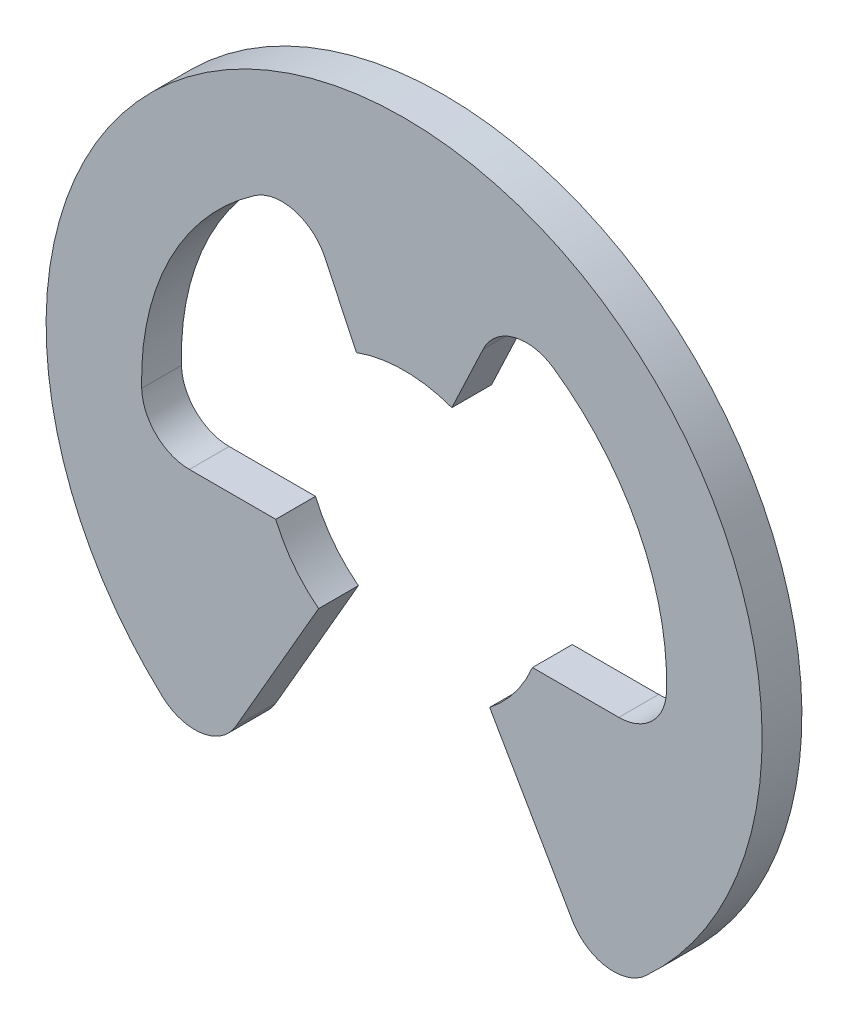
ISO-10303-21;
HEADER;
FILE_DESCRIPTION(('STEP AP214'),'2;1');
FILE_NAME('part.step','',(''),(''),'','','');
FILE_SCHEMA(('AUTOMOTIVE_DESIGN { 1 0 10303 214 1 1 1 1 }'));
ENDSEC;
DATA;
#1=APPLICATION_CONTEXT('core data for automotive mechanical design processes');
#2=APPLICATION_PROTOCOL_DEFINITION('international standard','automotive_design',2000,#1);
#3=PRODUCT_CONTEXT('',#1,'mechanical');
#4=PRODUCT('Part','Part','',(#3));
#5=PRODUCT_RELATED_PRODUCT_CATEGORY('part','',(#4));
#6=PRODUCT_DEFINITION_FORMATION('','',#4);
#7=PRODUCT_DEFINITION_CONTEXT('part definition',#1,'design');
#8=PRODUCT_DEFINITION('design','',#6,#7);
#9=PRODUCT_DEFINITION_SHAPE('','',#8);
#10=(LENGTH_UNIT() NAMED_UNIT(*) SI_UNIT(.MILLI.,.METRE.));
#11=(NAMED_UNIT(*) PLANE_ANGLE_UNIT() SI_UNIT($,.RADIAN.));
#12=(NAMED_UNIT(*) SI_UNIT($,.STERADIAN.) SOLID_ANGLE_UNIT());
#13=UNCERTAINTY_MEASURE_WITH_UNIT(LENGTH_MEASURE(1.E-05),#10,'distance_accuracy_value','');
#14=(GEOMETRIC_REPRESENTATION_CONTEXT(3) GLOBAL_UNCERTAINTY_ASSIGNED_CONTEXT((#13)) GLOBAL_UNIT_ASSIGNED_CONTEXT((#10,
#11,#12)) REPRESENTATION_CONTEXT('',''));
#15=CARTESIAN_POINT('',(0.,0.,0.));
#16=DIRECTION('',(0.,0.,1.));
#17=DIRECTION('',(1.,0.,0.));
#18=AXIS2_PLACEMENT_3D('',#15,#16,#17);
#19=CARTESIAN_POINT('',(0.67174142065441,0.32292759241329,0.));
#20=DIRECTION('',(0.,0.,-1.));
#21=DIRECTION('',(-1.,0.,0.));
#22=AXIS2_PLACEMENT_3D('',#19,#20,#21);
#23=CYLINDRICAL_SURFACE('',#22,3.29999999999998);
#24=CARTESIAN_POINT('',(0.67174142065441,0.32292759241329,-0.5));
#25=DIRECTION('',(0.,0.,1.));
#26=DIRECTION('',(1.,0.,0.));
#27=AXIS2_PLACEMENT_3D('',#24,#25,#26);
#28=CIRCLE('',#27,3.29999999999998);
#29=CARTESIAN_POINT('',(3.97037244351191,0.227883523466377,-0.5));
#30=VERTEX_POINT('',#29);
#31=CARTESIAN_POINT('',(2.54863712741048,3.03719775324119,-0.5));
#32=VERTEX_POINT('',#31);
#33=EDGE_CURVE('E474',#30,#32,#28,.T.);
#34=ORIENTED_EDGE('',*,*,#33,.F.);
#35=DIRECTION('',(0.,0.,-1.));
#36=VECTOR('',#35,1.);
#37=CARTESIAN_POINT('',(3.97037244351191,0.227883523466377,0.));
#38=LINE('',#37,#36);
#39=CARTESIAN_POINT('',(3.97037244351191,0.227883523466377,0.));
#40=VERTEX_POINT('',#39);
#41=EDGE_CURVE('E11',#40,#30,#38,.T.);
#42=ORIENTED_EDGE('',*,*,#41,.F.);
#43=CARTESIAN_POINT('',(0.67174142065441,0.32292759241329,0.));
#44=DIRECTION('',(0.,0.,1.));
#45=DIRECTION('',(1.,0.,0.));
#46=AXIS2_PLACEMENT_3D('',#43,#44,#45);
#47=CIRCLE('',#46,3.29999999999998);
#48=CARTESIAN_POINT('',(2.54863712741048,3.03719775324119,0.));
#49=VERTEX_POINT('',#48);
#50=EDGE_CURVE('E476',#40,#49,#47,.T.);
#51=ORIENTED_EDGE('',*,*,#50,.T.);
#52=DIRECTION('',(0.,0.,-1.));
#53=VECTOR('',#52,1.);
#54=CARTESIAN_POINT('',(2.54863712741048,3.03719775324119,0.));
#55=LINE('',#54,#53);
#56=EDGE_CURVE('E353',#49,#32,#55,.T.);
#57=ORIENTED_EDGE('',*,*,#56,.T.);
#58=EDGE_LOOP('',(#34,#42,#51,#57));
#59=FACE_BOUND('',#58,.T.);
#60=ADVANCED_FACE('F350',(#59),#23,.F.);
#61=CARTESIAN_POINT('',(3.3706213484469,0.2451642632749,0.));
#62=DIRECTION('',(0.,0.,-1.));
#63=DIRECTION('',(-1.,0.,0.));
#64=AXIS2_PLACEMENT_3D('',#61,#62,#63);
#65=CYLINDRICAL_SURFACE('',#64,0.600000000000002);
#66=CARTESIAN_POINT('',(3.3706213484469,0.2451642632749,-0.5));
#67=DIRECTION('',(0.,0.,1.));
#68=DIRECTION('',(1.,0.,0.));
#69=AXIS2_PLACEMENT_3D('',#66,#67,#68);
#70=CIRCLE('',#69,0.600000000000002);
#71=CARTESIAN_POINT('',(3.3706213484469,-0.3548357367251,-0.499999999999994));
#72=VERTEX_POINT('',#71);
#73=EDGE_CURVE('E492',#72,#30,#70,.T.);
#74=ORIENTED_EDGE('',*,*,#73,.F.);
#75=DIRECTION('',(0.,0.,-1.));
#76=VECTOR('',#75,1.);
#77=CARTESIAN_POINT('',(3.3706213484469,-0.3548357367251,0.));
#78=LINE('',#77,#76);
#79=CARTESIAN_POINT('',(3.3706213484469,-0.3548357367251,0.));
#80=VERTEX_POINT('',#79);
#81=EDGE_CURVE('E358',#80,#72,#78,.T.);
#82=ORIENTED_EDGE('',*,*,#81,.F.);
#83=CARTESIAN_POINT('',(3.3706213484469,0.2451642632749,0.));
#84=DIRECTION('',(0.,0.,1.));
#85=DIRECTION('',(1.,0.,0.));
#86=AXIS2_PLACEMENT_3D('',#83,#84,#85);
#87=CIRCLE('',#86,0.600000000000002);
#88=EDGE_CURVE('E481',#80,#40,#87,.T.);
#89=ORIENTED_EDGE('',*,*,#88,.T.);
#90=ORIENTED_EDGE('',*,*,#41,.T.);
#91=EDGE_LOOP('',(#74,#82,#89,#90));
#92=FACE_BOUND('',#91,.T.);
#93=ADVANCED_FACE('F671',(#92),#65,.F.);
#94=CARTESIAN_POINT('',(2.28516537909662,-0.354835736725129,0.));
#95=DIRECTION('',(0.,1.,0.));
#96=DIRECTION('',(-1.,0.,0.));
#97=AXIS2_PLACEMENT_3D('',#94,#95,#96);
#98=PLANE('',#97);
#99=DIRECTION('',(1.,0.,0.));
#100=VECTOR('',#99,1.);
#101=CARTESIAN_POINT('',(2.28516537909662,-0.354835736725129,-0.5));
#102=LINE('',#101,#100);
#103=CARTESIAN_POINT('',(2.28516537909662,-0.354835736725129,-0.5));
#104=VERTEX_POINT('',#103);
#105=EDGE_CURVE('E535',#104,#72,#102,.T.);
#106=ORIENTED_EDGE('',*,*,#105,.F.);
#107=DIRECTION('',(0.,0.,-1.));
#108=VECTOR('',#107,1.);
#109=CARTESIAN_POINT('',(2.28516537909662,-0.354835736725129,0.));
#110=LINE('',#109,#108);
#111=CARTESIAN_POINT('',(2.28516537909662,-0.354835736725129,0.));
#112=VERTEX_POINT('',#111);
#113=EDGE_CURVE('E587',#112,#104,#110,.T.);
#114=ORIENTED_EDGE('',*,*,#113,.F.);
#115=DIRECTION('',(1.,0.,0.));
#116=VECTOR('',#115,1.);
#117=CARTESIAN_POINT('',(2.28516537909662,-0.354835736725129,0.));
#118=LINE('',#117,#116);
#119=EDGE_CURVE('E583',#112,#80,#118,.T.);
#120=ORIENTED_EDGE('',*,*,#119,.T.);
#121=ORIENTED_EDGE('',*,*,#81,.T.);
#122=EDGE_LOOP('',(#106,#114,#120,#121));
#123=FACE_BOUND('',#122,.T.);
#124=ADVANCED_FACE('F676',(#123),#98,.T.);
#125=CARTESIAN_POINT('',(0.67174142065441,0.32292759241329,0.));
#126=DIRECTION('',(0.,0.,-1.));
#127=DIRECTION('',(-1.,0.,0.));
#128=AXIS2_PLACEMENT_3D('',#125,#126,#127);
#129=CYLINDRICAL_SURFACE('',#128,1.75000000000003);
#130=CARTESIAN_POINT('',(0.67174142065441,0.32292759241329,-0.5));
#131=DIRECTION('',(0.,0.,1.));
#132=DIRECTION('',(1.,0.,0.));
#133=AXIS2_PLACEMENT_3D('',#130,#131,#132);
#134=CIRCLE('',#133,1.75000000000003);
#135=CARTESIAN_POINT('',(1.7468541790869,-1.057881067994,-0.500000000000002));
#136=VERTEX_POINT('',#135);
#137=EDGE_CURVE('E532',#136,#104,#134,.T.);
#138=ORIENTED_EDGE('',*,*,#137,.F.);
#139=DIRECTION('',(0.,0.,-1.));
#140=VECTOR('',#139,1.);
#141=CARTESIAN_POINT('',(1.7468541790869,-1.057881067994,0.));
#142=LINE('',#141,#140);
#143=CARTESIAN_POINT('',(1.7468541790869,-1.057881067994,0.));
#144=VERTEX_POINT('',#143);
#145=EDGE_CURVE('E589',#144,#136,#142,.T.);
#146=ORIENTED_EDGE('',*,*,#145,.F.);
#147=CARTESIAN_POINT('',(0.67174142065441,0.32292759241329,0.));
#148=DIRECTION('',(0.,0.,1.));
#149=DIRECTION('',(1.,0.,0.));
#150=AXIS2_PLACEMENT_3D('',#147,#148,#149);
#151=CIRCLE('',#150,1.75000000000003);
#152=EDGE_CURVE('E580',#144,#112,#151,.T.);
#153=ORIENTED_EDGE('',*,*,#152,.T.);
#154=ORIENTED_EDGE('',*,*,#113,.T.);
#155=EDGE_LOOP('',(#138,#146,#153,#154));
#156=FACE_BOUND('',#155,.T.);
#157=ADVANCED_FACE('F668',(#156),#129,.F.);
#158=CARTESIAN_POINT('',(2.78432644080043,-2.85483573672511,0.));
#159=DIRECTION('',(-0.866025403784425,-0.500000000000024,0.));
#160=DIRECTION('',(0.500000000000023,-0.866025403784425,0.));
#161=AXIS2_PLACEMENT_3D('',#158,#159,#160);
#162=PLANE('',#161);
#163=DIRECTION('',(-0.500000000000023,0.866025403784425,0.));
#164=VECTOR('',#163,1.);
#165=CARTESIAN_POINT('',(2.78432644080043,-2.85483573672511,-0.5));
#166=LINE('',#165,#164);
#167=CARTESIAN_POINT('',(2.78432644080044,-2.8548357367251,-0.5));
#168=VERTEX_POINT('',#167);
#169=EDGE_CURVE('E529',#168,#136,#166,.T.);
#170=ORIENTED_EDGE('',*,*,#169,.F.);
#171=DIRECTION('',(0.,0.,-1.));
#172=VECTOR('',#171,1.);
#173=CARTESIAN_POINT('',(2.78432644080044,-2.8548357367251,0.));
#174=LINE('',#173,#172);
#175=CARTESIAN_POINT('',(2.78432644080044,-2.8548357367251,0.));
#176=VERTEX_POINT('',#175);
#177=EDGE_CURVE('E591',#176,#168,#174,.T.);
#178=ORIENTED_EDGE('',*,*,#177,.F.);
#179=DIRECTION('',(-0.500000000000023,0.866025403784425,0.));
#180=VECTOR('',#179,1.);
#181=CARTESIAN_POINT('',(2.78432644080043,-2.85483573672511,0.));
#182=LINE('',#181,#180);
#183=EDGE_CURVE('E577',#176,#144,#182,.T.);
#184=ORIENTED_EDGE('',*,*,#183,.T.);
#185=ORIENTED_EDGE('',*,*,#145,.T.);
#186=EDGE_LOOP('',(#170,#178,#184,#185));
#187=FACE_BOUND('',#186,.T.);
#188=ADVANCED_FACE('F664',(#187),#162,.T.);
#189=CARTESIAN_POINT('',(3.3039416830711,-2.5548357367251,0.));
#190=DIRECTION('',(0.,0.,-1.));
#191=DIRECTION('',(-1.,0.,0.));
#192=AXIS2_PLACEMENT_3D('',#189,#190,#191);
#193=CYLINDRICAL_SURFACE('',#192,0.600000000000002);
#194=CARTESIAN_POINT('',(3.3039416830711,-2.5548357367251,-0.5));
#195=DIRECTION('',(0.,0.,-1.));
#196=DIRECTION('',(-1.,0.,0.));
#197=AXIS2_PLACEMENT_3D('',#194,#195,#196);
#198=CIRCLE('',#197,0.600000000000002);
#199=CARTESIAN_POINT('',(3.70889556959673,-2.99756855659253,-0.5));
#200=VERTEX_POINT('',#199);
#201=EDGE_CURVE('E526',#200,#168,#198,.T.);
#202=ORIENTED_EDGE('',*,*,#201,.F.);
#203=DIRECTION('',(0.,0.,-1.));
#204=VECTOR('',#203,1.);
#205=CARTESIAN_POINT('',(3.70889556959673,-2.99756855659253,0.));
#206=LINE('',#205,#204);
#207=CARTESIAN_POINT('',(3.70889556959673,-2.99756855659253,0.));
#208=VERTEX_POINT('',#207);
#209=EDGE_CURVE('E593',#208,#200,#206,.T.);
#210=ORIENTED_EDGE('',*,*,#209,.F.);
#211=CARTESIAN_POINT('',(3.3039416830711,-2.5548357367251,0.));
#212=DIRECTION('',(0.,0.,-1.));
#213=DIRECTION('',(-1.,0.,0.));
#214=AXIS2_PLACEMENT_3D('',#211,#212,#213);
#215=CIRCLE('',#214,0.600000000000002);
#216=EDGE_CURVE('E574',#208,#176,#215,.T.);
#217=ORIENTED_EDGE('',*,*,#216,.T.);
#218=ORIENTED_EDGE('',*,*,#177,.T.);
#219=EDGE_LOOP('',(#202,#210,#217,#218));
#220=FACE_BOUND('',#219,.T.);
#221=ADVANCED_FACE('F660',(#220),#193,.T.);
#222=CARTESIAN_POINT('',(0.67174142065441,0.32292759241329,0.));
#223=DIRECTION('',(0.,0.,-1.));
#224=DIRECTION('',(-1.,0.,0.));
#225=AXIS2_PLACEMENT_3D('',#222,#223,#224);
#226=CYLINDRICAL_SURFACE('',#225,4.5);
#227=CARTESIAN_POINT('',(0.67174142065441,0.32292759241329,-0.5));
#228=DIRECTION('',(0.,0.,-1.));
#229=DIRECTION('',(-1.,0.,0.));
#230=AXIS2_PLACEMENT_3D('',#227,#228,#229);
#231=CIRCLE('',#230,4.5);
#232=CARTESIAN_POINT('',(-2.36541272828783,-2.99756855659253,-0.5));
#233=VERTEX_POINT('',#232);
#234=EDGE_CURVE('E523',#233,#200,#231,.T.);
#235=ORIENTED_EDGE('',*,*,#234,.F.);
#236=DIRECTION('',(0.,0.,-1.));
#237=VECTOR('',#236,1.);
#238=CARTESIAN_POINT('',(-2.36541272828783,-2.99756855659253,0.));
#239=LINE('',#238,#237);
#240=CARTESIAN_POINT('',(-2.36541272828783,-2.99756855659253,0.));
#241=VERTEX_POINT('',#240);
#242=EDGE_CURVE('E595',#241,#233,#239,.T.);
#243=ORIENTED_EDGE('',*,*,#242,.F.);
#244=CARTESIAN_POINT('',(0.67174142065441,0.32292759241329,0.));
#245=DIRECTION('',(0.,0.,-1.));
#246=DIRECTION('',(-1.,0.,0.));
#247=AXIS2_PLACEMENT_3D('',#244,#245,#246);
#248=CIRCLE('',#247,4.5);
#249=EDGE_CURVE('E571',#241,#208,#248,.T.);
#250=ORIENTED_EDGE('',*,*,#249,.T.);
#251=ORIENTED_EDGE('',*,*,#209,.T.);
#252=EDGE_LOOP('',(#235,#243,#250,#251));
#253=FACE_BOUND('',#252,.T.);
#254=ADVANCED_FACE('F656',(#253),#226,.T.);
#255=CARTESIAN_POINT('',(-1.9604588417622,-2.5548357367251,0.));
#256=DIRECTION('',(0.,0.,-1.));
#257=DIRECTION('',(-1.,0.,0.));
#258=AXIS2_PLACEMENT_3D('',#255,#256,#257);
#259=CYLINDRICAL_SURFACE('',#258,0.599999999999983);
#260=CARTESIAN_POINT('',(-1.9604588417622,-2.5548357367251,-0.5));
#261=DIRECTION('',(0.,0.,-1.));
#262=DIRECTION('',(-1.,0.,0.));
#263=AXIS2_PLACEMENT_3D('',#260,#261,#262);
#264=CIRCLE('',#263,0.599999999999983);
#265=CARTESIAN_POINT('',(-1.4408435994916,-2.85483573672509,-0.500000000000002));
#266=VERTEX_POINT('',#265);
#267=EDGE_CURVE('E520',#266,#233,#264,.T.);
#268=ORIENTED_EDGE('',*,*,#267,.F.);
#269=DIRECTION('',(0.,0.,-1.));
#270=VECTOR('',#269,1.);
#271=CARTESIAN_POINT('',(-1.4408435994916,-2.85483573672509,0.));
#272=LINE('',#271,#270);
#273=CARTESIAN_POINT('',(-1.4408435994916,-2.85483573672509,0.));
#274=VERTEX_POINT('',#273);
#275=EDGE_CURVE('E597',#274,#266,#272,.T.);
#276=ORIENTED_EDGE('',*,*,#275,.F.);
#277=CARTESIAN_POINT('',(-1.9604588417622,-2.5548357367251,0.));
#278=DIRECTION('',(0.,0.,-1.));
#279=DIRECTION('',(-1.,0.,0.));
#280=AXIS2_PLACEMENT_3D('',#277,#278,#279);
#281=CIRCLE('',#280,0.599999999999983);
#282=EDGE_CURVE('E568',#274,#241,#281,.T.);
#283=ORIENTED_EDGE('',*,*,#282,.T.);
#284=ORIENTED_EDGE('',*,*,#242,.T.);
#285=EDGE_LOOP('',(#268,#276,#283,#284));
#286=FACE_BOUND('',#285,.T.);
#287=ADVANCED_FACE('F652',(#286),#259,.T.);
#288=CARTESIAN_POINT('',(-0.40337133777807,-1.05788106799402,0.));
#289=DIRECTION('',(0.866025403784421,-0.50000000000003,0.));
#290=DIRECTION('',(0.50000000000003,0.866025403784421,0.));
#291=AXIS2_PLACEMENT_3D('',#288,#289,#290);
#292=PLANE('',#291);
#293=DIRECTION('',(-0.50000000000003,-0.866025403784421,0.));
#294=VECTOR('',#293,1.);
#295=CARTESIAN_POINT('',(-0.40337133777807,-1.05788106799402,-0.5));
#296=LINE('',#295,#294);
#297=CARTESIAN_POINT('',(-0.403371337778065,-1.05788106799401,-0.5));
#298=VERTEX_POINT('',#297);
#299=EDGE_CURVE('E517',#298,#266,#296,.T.);
#300=ORIENTED_EDGE('',*,*,#299,.F.);
#301=DIRECTION('',(0.,0.,-1.));
#302=VECTOR('',#301,1.);
#303=CARTESIAN_POINT('',(-0.403371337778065,-1.05788106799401,0.));
#304=LINE('',#303,#302);
#305=CARTESIAN_POINT('',(-0.403371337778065,-1.05788106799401,0.));
#306=VERTEX_POINT('',#305);
#307=EDGE_CURVE('E599',#306,#298,#304,.T.);
#308=ORIENTED_EDGE('',*,*,#307,.F.);
#309=DIRECTION('',(-0.50000000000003,-0.866025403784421,0.));
#310=VECTOR('',#309,1.);
#311=CARTESIAN_POINT('',(-0.40337133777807,-1.05788106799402,0.));
#312=LINE('',#311,#310);
#313=EDGE_CURVE('E565',#306,#274,#312,.T.);
#314=ORIENTED_EDGE('',*,*,#313,.T.);
#315=ORIENTED_EDGE('',*,*,#275,.T.);
#316=EDGE_LOOP('',(#300,#308,#314,#315));
#317=FACE_BOUND('',#316,.T.);
#318=ADVANCED_FACE('F648',(#317),#292,.T.);
#319=CARTESIAN_POINT('',(0.67174142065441,0.32292759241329,0.));
#320=DIRECTION('',(0.,0.,-1.));
#321=DIRECTION('',(-1.,0.,0.));
#322=AXIS2_PLACEMENT_3D('',#319,#320,#321);
#323=CYLINDRICAL_SURFACE('',#322,1.75000000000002);
#324=CARTESIAN_POINT('',(0.67174142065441,0.32292759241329,-0.5));
#325=DIRECTION('',(0.,0.,1.));
#326=DIRECTION('',(1.,0.,0.));
#327=AXIS2_PLACEMENT_3D('',#324,#325,#326);
#328=CIRCLE('',#327,1.75000000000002);
#329=CARTESIAN_POINT('',(-0.941682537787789,-0.3548357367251,-0.499999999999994));
#330=VERTEX_POINT('',#329);
#331=EDGE_CURVE('E514',#330,#298,#328,.T.);
#332=ORIENTED_EDGE('',*,*,#331,.F.);
#333=DIRECTION('',(0.,0.,-1.));
#334=VECTOR('',#333,1.);
#335=CARTESIAN_POINT('',(-0.941682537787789,-0.3548357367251,0.));
#336=LINE('',#335,#334);
#337=CARTESIAN_POINT('',(-0.941682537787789,-0.3548357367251,0.));
#338=VERTEX_POINT('',#337);
#339=EDGE_CURVE('E601',#338,#330,#336,.T.);
#340=ORIENTED_EDGE('',*,*,#339,.F.);
#341=CARTESIAN_POINT('',(0.67174142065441,0.32292759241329,0.));
#342=DIRECTION('',(0.,0.,1.));
#343=DIRECTION('',(1.,0.,0.));
#344=AXIS2_PLACEMENT_3D('',#341,#342,#343);
#345=CIRCLE('',#344,1.75000000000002);
#346=EDGE_CURVE('E562',#338,#306,#345,.T.);
#347=ORIENTED_EDGE('',*,*,#346,.T.);
#348=ORIENTED_EDGE('',*,*,#307,.T.);
#349=EDGE_LOOP('',(#332,#340,#347,#348));
#350=FACE_BOUND('',#349,.T.);
#351=ADVANCED_FACE('F644',(#350),#323,.F.);
#352=CARTESIAN_POINT('',(-2.02713850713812,-0.354835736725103,0.));
#353=DIRECTION('',(0.,1.,0.));
#354=DIRECTION('',(-1.,0.,0.));
#355=AXIS2_PLACEMENT_3D('',#352,#353,#354);
#356=PLANE('',#355);
#357=DIRECTION('',(1.,0.,0.));
#358=VECTOR('',#357,1.);
#359=CARTESIAN_POINT('',(-2.02713850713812,-0.354835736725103,-0.5));
#360=LINE('',#359,#358);
#361=CARTESIAN_POINT('',(-2.02713850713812,-0.354835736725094,-0.5));
#362=VERTEX_POINT('',#361);
#363=EDGE_CURVE('E511',#362,#330,#360,.T.);
#364=ORIENTED_EDGE('',*,*,#363,.F.);
#365=DIRECTION('',(0.,0.,-1.));
#366=VECTOR('',#365,1.);
#367=CARTESIAN_POINT('',(-2.02713850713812,-0.354835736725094,0.));
#368=LINE('',#367,#366);
#369=CARTESIAN_POINT('',(-2.02713850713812,-0.354835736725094,0.));
#370=VERTEX_POINT('',#369);
#371=EDGE_CURVE('E603',#370,#362,#368,.T.);
#372=ORIENTED_EDGE('',*,*,#371,.F.);
#373=DIRECTION('',(1.,0.,0.));
#374=VECTOR('',#373,1.);
#375=CARTESIAN_POINT('',(-2.02713850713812,-0.354835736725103,0.));
#376=LINE('',#375,#374);
#377=EDGE_CURVE('E559',#370,#338,#376,.T.);
#378=ORIENTED_EDGE('',*,*,#377,.T.);
#379=ORIENTED_EDGE('',*,*,#339,.T.);
#380=EDGE_LOOP('',(#364,#372,#378,#379));
#381=FACE_BOUND('',#380,.T.);
#382=ADVANCED_FACE('F640',(#381),#356,.T.);
#383=CARTESIAN_POINT('',(-2.0271385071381,0.2451642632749,0.));
#384=DIRECTION('',(0.,0.,-1.));
#385=DIRECTION('',(-1.,0.,0.));
#386=AXIS2_PLACEMENT_3D('',#383,#384,#385);
#387=CYLINDRICAL_SURFACE('',#386,0.599999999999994);
#388=CARTESIAN_POINT('',(-2.0271385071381,0.2451642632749,-0.5));
#389=DIRECTION('',(0.,0.,1.));
#390=DIRECTION('',(1.,0.,0.));
#391=AXIS2_PLACEMENT_3D('',#388,#389,#390);
#392=CIRCLE('',#391,0.599999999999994);
#393=CARTESIAN_POINT('',(-2.62688960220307,0.227883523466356,-0.5));
#394=VERTEX_POINT('',#393);
#395=EDGE_CURVE('E508',#394,#362,#392,.T.);
#396=ORIENTED_EDGE('',*,*,#395,.F.);
#397=DIRECTION('',(0.,0.,-1.));
#398=VECTOR('',#397,1.);
#399=CARTESIAN_POINT('',(-2.62688960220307,0.227883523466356,0.));
#400=LINE('',#399,#398);
#401=CARTESIAN_POINT('',(-2.62688960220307,0.227883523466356,0.));
#402=VERTEX_POINT('',#401);
#403=EDGE_CURVE('E605',#402,#394,#400,.T.);
#404=ORIENTED_EDGE('',*,*,#403,.F.);
#405=CARTESIAN_POINT('',(-2.0271385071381,0.2451642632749,0.));
#406=DIRECTION('',(0.,0.,1.));
#407=DIRECTION('',(1.,0.,0.));
#408=AXIS2_PLACEMENT_3D('',#405,#406,#407);
#409=CIRCLE('',#408,0.599999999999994);
#410=EDGE_CURVE('E556',#402,#370,#409,.T.);
#411=ORIENTED_EDGE('',*,*,#410,.T.);
#412=ORIENTED_EDGE('',*,*,#371,.T.);
#413=EDGE_LOOP('',(#396,#404,#411,#412));
#414=FACE_BOUND('',#413,.T.);
#415=ADVANCED_FACE('F636',(#414),#387,.F.);
#416=CARTESIAN_POINT('',(0.67174142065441,0.32292759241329,0.));
#417=DIRECTION('',(0.,0.,-1.));
#418=DIRECTION('',(-1.,0.,0.));
#419=AXIS2_PLACEMENT_3D('',#416,#417,#418);
#420=CYLINDRICAL_SURFACE('',#419,3.29999999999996);
#421=CARTESIAN_POINT('',(0.67174142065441,0.32292759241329,-0.5));
#422=DIRECTION('',(0.,0.,1.));
#423=DIRECTION('',(1.,0.,0.));
#424=AXIS2_PLACEMENT_3D('',#421,#422,#423);
#425=CIRCLE('',#424,3.29999999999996);
#426=CARTESIAN_POINT('',(-1.20515428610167,3.03719775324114,-0.5));
#427=VERTEX_POINT('',#426);
#428=EDGE_CURVE('E505',#427,#394,#425,.T.);
#429=ORIENTED_EDGE('',*,*,#428,.F.);
#430=DIRECTION('',(0.,0.,-1.));
#431=VECTOR('',#430,1.);
#432=CARTESIAN_POINT('',(-1.20515428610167,3.03719775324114,0.));
#433=LINE('',#432,#431);
#434=CARTESIAN_POINT('',(-1.20515428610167,3.03719775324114,0.));
#435=VERTEX_POINT('',#434);
#436=EDGE_CURVE('E607',#435,#427,#433,.T.);
#437=ORIENTED_EDGE('',*,*,#436,.F.);
#438=CARTESIAN_POINT('',(0.67174142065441,0.32292759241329,0.));
#439=DIRECTION('',(0.,0.,1.));
#440=DIRECTION('',(1.,0.,0.));
#441=AXIS2_PLACEMENT_3D('',#438,#439,#440);
#442=CIRCLE('',#441,3.29999999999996);
#443=EDGE_CURVE('E553',#435,#402,#442,.T.);
#444=ORIENTED_EDGE('',*,*,#443,.T.);
#445=ORIENTED_EDGE('',*,*,#403,.T.);
#446=EDGE_LOOP('',(#429,#437,#444,#445));
#447=FACE_BOUND('',#446,.T.);
#448=ADVANCED_FACE('F632',(#447),#420,.F.);
#449=CARTESIAN_POINT('',(-0.86390052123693,2.5436940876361,0.));
#450=DIRECTION('',(0.,0.,-1.));
#451=DIRECTION('',(-1.,0.,0.));
#452=AXIS2_PLACEMENT_3D('',#449,#450,#451);
#453=CYLINDRICAL_SURFACE('',#452,0.599999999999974);
#454=CARTESIAN_POINT('',(-0.86390052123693,2.5436940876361,-0.5));
#455=DIRECTION('',(0.,0.,1.));
#456=DIRECTION('',(1.,0.,0.));
#457=AXIS2_PLACEMENT_3D('',#454,#455,#456);
#458=CIRCLE('',#457,0.599999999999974);
#459=CARTESIAN_POINT('',(-0.32127885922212,2.799744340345,-0.5));
#460=VERTEX_POINT('',#459);
#461=EDGE_CURVE('E502',#460,#427,#458,.T.);
#462=ORIENTED_EDGE('',*,*,#461,.F.);
#463=DIRECTION('',(0.,0.,-1.));
#464=VECTOR('',#463,1.);
#465=CARTESIAN_POINT('',(-0.32127885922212,2.799744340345,0.));
#466=LINE('',#465,#464);
#467=CARTESIAN_POINT('',(-0.32127885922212,2.799744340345,0.));
#468=VERTEX_POINT('',#467);
#469=EDGE_CURVE('E609',#468,#460,#466,.T.);
#470=ORIENTED_EDGE('',*,*,#469,.F.);
#471=CARTESIAN_POINT('',(-0.86390052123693,2.5436940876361,0.));
#472=DIRECTION('',(0.,0.,1.));
#473=DIRECTION('',(1.,0.,0.));
#474=AXIS2_PLACEMENT_3D('',#471,#472,#473);
#475=CIRCLE('',#474,0.599999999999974);
#476=EDGE_CURVE('E550',#468,#435,#475,.T.);
#477=ORIENTED_EDGE('',*,*,#476,.T.);
#478=ORIENTED_EDGE('',*,*,#436,.T.);
#479=EDGE_LOOP('',(#462,#470,#477,#478));
#480=FACE_BOUND('',#479,.T.);
#481=ADVANCED_FACE('F628',(#480),#453,.F.);
#482=CARTESIAN_POINT('',(0.0717414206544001,1.96685581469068,0.));
#483=DIRECTION('',(-0.904369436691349,-0.426750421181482,0.));
#484=DIRECTION('',(0.426750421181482,-0.904369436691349,0.));
#485=AXIS2_PLACEMENT_3D('',#482,#483,#484);
#486=PLANE('',#485);
#487=DIRECTION('',(-0.426750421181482,0.904369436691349,0.));
#488=VECTOR('',#487,1.);
#489=CARTESIAN_POINT('',(0.0717414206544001,1.96685581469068,-0.5));
#490=LINE('',#489,#488);
#491=CARTESIAN_POINT('',(0.0717414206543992,1.96685581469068,-0.5));
#492=VERTEX_POINT('',#491);
#493=EDGE_CURVE('E499',#492,#460,#490,.T.);
#494=ORIENTED_EDGE('',*,*,#493,.F.);
#495=DIRECTION('',(0.,0.,-1.));
#496=VECTOR('',#495,1.);
#497=CARTESIAN_POINT('',(0.0717414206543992,1.96685581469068,0.));
#498=LINE('',#497,#496);
#499=CARTESIAN_POINT('',(0.0717414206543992,1.96685581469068,0.));
#500=VERTEX_POINT('',#499);
#501=EDGE_CURVE('E611',#500,#492,#498,.T.);
#502=ORIENTED_EDGE('',*,*,#501,.F.);
#503=DIRECTION('',(-0.426750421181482,0.904369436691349,0.));
#504=VECTOR('',#503,1.);
#505=CARTESIAN_POINT('',(0.0717414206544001,1.96685581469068,0.));
#506=LINE('',#505,#504);
#507=EDGE_CURVE('E547',#500,#468,#506,.T.);
#508=ORIENTED_EDGE('',*,*,#507,.T.);
#509=ORIENTED_EDGE('',*,*,#469,.T.);
#510=EDGE_LOOP('',(#494,#502,#508,#509));
#511=FACE_BOUND('',#510,.T.);
#512=ADVANCED_FACE('F624',(#511),#486,.T.);
#513=CARTESIAN_POINT('',(0.67174142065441,0.32292759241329,0.));
#514=DIRECTION('',(0.,0.,-1.));
#515=DIRECTION('',(-1.,0.,0.));
#516=AXIS2_PLACEMENT_3D('',#513,#514,#515);
#517=CYLINDRICAL_SURFACE('',#516,1.75000000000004);
#518=CARTESIAN_POINT('',(0.67174142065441,0.32292759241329,-0.5));
#519=DIRECTION('',(0.,0.,1.));
#520=DIRECTION('',(1.,0.,0.));
#521=AXIS2_PLACEMENT_3D('',#518,#519,#520);
#522=CIRCLE('',#521,1.75000000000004);
#523=CARTESIAN_POINT('',(1.2717414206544,1.9668558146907,-0.5));
#524=VERTEX_POINT('',#523);
#525=EDGE_CURVE('E496',#524,#492,#522,.T.);
#526=ORIENTED_EDGE('',*,*,#525,.F.);
#527=DIRECTION('',(0.,0.,-1.));
#528=VECTOR('',#527,1.);
#529=CARTESIAN_POINT('',(1.2717414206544,1.9668558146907,0.));
#530=LINE('',#529,#528);
#531=CARTESIAN_POINT('',(1.2717414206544,1.9668558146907,0.));
#532=VERTEX_POINT('',#531);
#533=EDGE_CURVE('E613',#532,#524,#530,.T.);
#534=ORIENTED_EDGE('',*,*,#533,.F.);
#535=CARTESIAN_POINT('',(0.67174142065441,0.32292759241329,0.));
#536=DIRECTION('',(0.,0.,1.));
#537=DIRECTION('',(1.,0.,0.));
#538=AXIS2_PLACEMENT_3D('',#535,#536,#537);
#539=CIRCLE('',#538,1.75000000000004);
#540=EDGE_CURVE('E544',#532,#500,#539,.T.);
#541=ORIENTED_EDGE('',*,*,#540,.T.);
#542=ORIENTED_EDGE('',*,*,#501,.T.);
#543=EDGE_LOOP('',(#526,#534,#541,#542));
#544=FACE_BOUND('',#543,.T.);
#545=ADVANCED_FACE('F620',(#544),#517,.F.);
#546=CARTESIAN_POINT('',(1.66476170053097,2.79974434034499,0.));
#547=DIRECTION('',(0.90436943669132,-0.426750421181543,0.));
#548=DIRECTION('',(0.426750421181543,0.90436943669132,0.));
#549=AXIS2_PLACEMENT_3D('',#546,#547,#548);
#550=PLANE('',#549);
#551=DIRECTION('',(-0.426750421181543,-0.90436943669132,0.));
#552=VECTOR('',#551,1.);
#553=CARTESIAN_POINT('',(1.66476170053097,2.79974434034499,-0.5));
#554=LINE('',#553,#552);
#555=CARTESIAN_POINT('',(1.66476170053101,2.79974434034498,-0.5));
#556=VERTEX_POINT('',#555);
#557=EDGE_CURVE('E488',#556,#524,#554,.T.);
#558=ORIENTED_EDGE('',*,*,#557,.F.);
#559=DIRECTION('',(0.,0.,-1.));
#560=VECTOR('',#559,1.);
#561=CARTESIAN_POINT('',(1.66476170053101,2.79974434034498,0.));
#562=LINE('',#561,#560);
#563=CARTESIAN_POINT('',(1.66476170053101,2.79974434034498,0.));
#564=VERTEX_POINT('',#563);
#565=EDGE_CURVE('E480',#564,#556,#562,.T.);
#566=ORIENTED_EDGE('',*,*,#565,.F.);
#567=DIRECTION('',(-0.426750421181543,-0.90436943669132,0.));
#568=VECTOR('',#567,1.);
#569=CARTESIAN_POINT('',(1.66476170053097,2.79974434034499,0.));
#570=LINE('',#569,#568);
#571=EDGE_CURVE('E541',#564,#532,#570,.T.);
#572=ORIENTED_EDGE('',*,*,#571,.T.);
#573=ORIENTED_EDGE('',*,*,#533,.T.);
#574=EDGE_LOOP('',(#558,#566,#572,#573));
#575=FACE_BOUND('',#574,.T.);
#576=ADVANCED_FACE('F616',(#575),#550,.T.);
#577=CARTESIAN_POINT('',(2.2073833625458,2.5436940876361,0.));
#578=DIRECTION('',(0.,0.,-1.));
#579=DIRECTION('',(-1.,0.,0.));
#580=AXIS2_PLACEMENT_3D('',#577,#578,#579);
#581=CYLINDRICAL_SURFACE('',#580,0.599999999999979);
#582=CARTESIAN_POINT('',(2.2073833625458,2.5436940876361,-0.5));
#583=DIRECTION('',(0.,0.,1.));
#584=DIRECTION('',(1.,0.,0.));
#585=AXIS2_PLACEMENT_3D('',#582,#583,#584);
#586=CIRCLE('',#585,0.599999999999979);
#587=EDGE_CURVE('E483',#32,#556,#586,.T.);
#588=ORIENTED_EDGE('',*,*,#587,.F.);
#589=ORIENTED_EDGE('',*,*,#56,.F.);
#590=CARTESIAN_POINT('',(2.2073833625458,2.5436940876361,0.));
#591=DIRECTION('',(0.,0.,1.));
#592=DIRECTION('',(1.,0.,0.));
#593=AXIS2_PLACEMENT_3D('',#590,#591,#592);
#594=CIRCLE('',#593,0.599999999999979);
#595=EDGE_CURVE('E539',#49,#564,#594,.T.);
#596=ORIENTED_EDGE('',*,*,#595,.T.);
#597=ORIENTED_EDGE('',*,*,#565,.T.);
#598=EDGE_LOOP('',(#588,#589,#596,#597));
#599=FACE_BOUND('',#598,.T.);
#600=ADVANCED_FACE('F484',(#599),#581,.F.);
#601=CARTESIAN_POINT('',(0.67174142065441,0.32292759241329,0.));
#602=DIRECTION('',(0.,0.,1.));
#603=DIRECTION('',(1.,0.,0.));
#604=AXIS2_PLACEMENT_3D('',#601,#602,#603);
#605=PLANE('',#604);
#606=ORIENTED_EDGE('',*,*,#50,.F.);
#607=ORIENTED_EDGE('',*,*,#88,.F.);
#608=ORIENTED_EDGE('',*,*,#119,.F.);
#609=ORIENTED_EDGE('',*,*,#152,.F.);
#610=ORIENTED_EDGE('',*,*,#183,.F.);
#611=ORIENTED_EDGE('',*,*,#216,.F.);
#612=ORIENTED_EDGE('',*,*,#249,.F.);
#613=ORIENTED_EDGE('',*,*,#282,.F.);
#614=ORIENTED_EDGE('',*,*,#313,.F.);
#615=ORIENTED_EDGE('',*,*,#346,.F.);
#616=ORIENTED_EDGE('',*,*,#377,.F.);
#617=ORIENTED_EDGE('',*,*,#410,.F.);
#618=ORIENTED_EDGE('',*,*,#443,.F.);
#619=ORIENTED_EDGE('',*,*,#476,.F.);
#620=ORIENTED_EDGE('',*,*,#507,.F.);
#621=ORIENTED_EDGE('',*,*,#540,.F.);
#622=ORIENTED_EDGE('',*,*,#571,.F.);
#623=ORIENTED_EDGE('',*,*,#595,.F.);
#624=EDGE_LOOP('',(#606,#607,#608,#609,#610,#611,#612,#613,#614,#615,#616,#617,#618,#619,#620,
#621,#622,#623));
#625=FACE_BOUND('',#624,.T.);
#626=ADVANCED_FACE('F675',(#625),#605,.T.);
#627=CARTESIAN_POINT('',(0.67174142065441,0.32292759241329,-0.5));
#628=DIRECTION('',(0.,0.,1.));
#629=DIRECTION('',(1.,0.,0.));
#630=AXIS2_PLACEMENT_3D('',#627,#628,#629);
#631=PLANE('',#630);
#632=ORIENTED_EDGE('',*,*,#33,.T.);
#633=ORIENTED_EDGE('',*,*,#587,.T.);
#634=ORIENTED_EDGE('',*,*,#557,.T.);
#635=ORIENTED_EDGE('',*,*,#525,.T.);
#636=ORIENTED_EDGE('',*,*,#493,.T.);
#637=ORIENTED_EDGE('',*,*,#461,.T.);
#638=ORIENTED_EDGE('',*,*,#428,.T.);
#639=ORIENTED_EDGE('',*,*,#395,.T.);
#640=ORIENTED_EDGE('',*,*,#363,.T.);
#641=ORIENTED_EDGE('',*,*,#331,.T.);
#642=ORIENTED_EDGE('',*,*,#299,.T.);
#643=ORIENTED_EDGE('',*,*,#267,.T.);
#644=ORIENTED_EDGE('',*,*,#234,.T.);
#645=ORIENTED_EDGE('',*,*,#201,.T.);
#646=ORIENTED_EDGE('',*,*,#169,.T.);
#647=ORIENTED_EDGE('',*,*,#137,.T.);
#648=ORIENTED_EDGE('',*,*,#105,.T.);
#649=ORIENTED_EDGE('',*,*,#73,.T.);
#650=EDGE_LOOP('',(#632,#633,#634,#635,#636,#637,#638,#639,#640,#641,#642,#643,#644,#645,#646,
#647,#648,#649));
#651=FACE_BOUND('',#650,.T.);
#652=ADVANCED_FACE('F490',(#651),#631,.F.);
#653=CLOSED_SHELL('',(#60,#93,#124,#157,#188,#221,#254,#287,#318,#351,#382,#415,#448,#481,#512,
#545,#576,#600,#626,#652));
#654=MANIFOLD_SOLID_BREP('B2',#653);
#655=ADVANCED_BREP_SHAPE_REPRESENTATION('',(#18,#654),#14);
#656=SHAPE_DEFINITION_REPRESENTATION(#9,#655);
ENDSEC;
END-ISO-10303-21;
